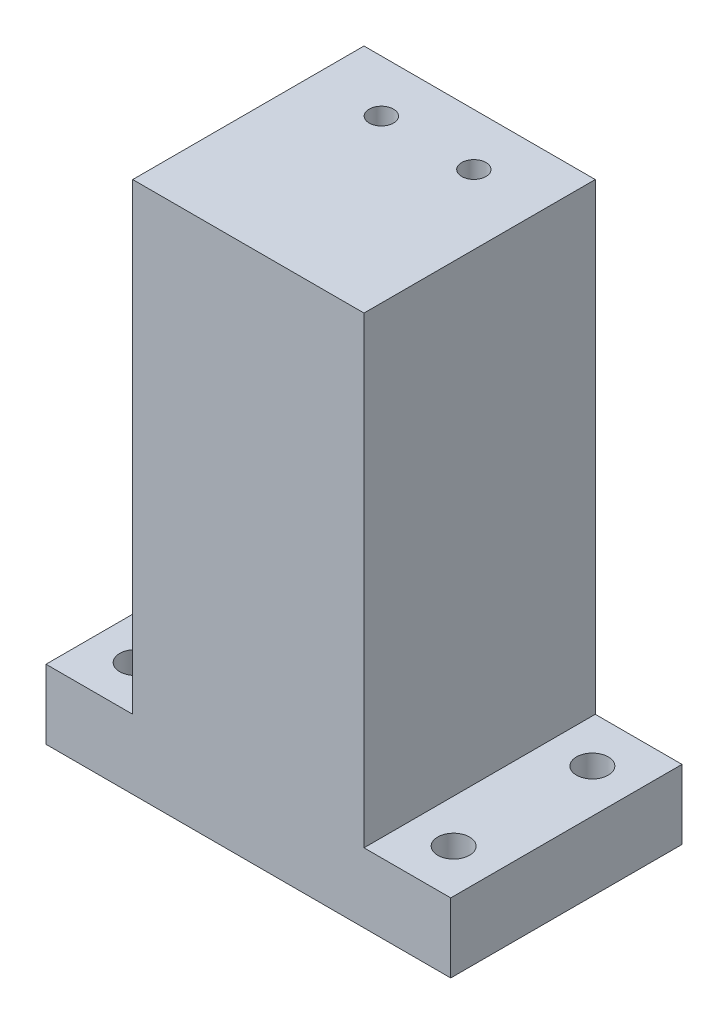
from build123d import *

# Parameters (mm, degrees)
EXTRUDE_1_DEPTH     = 40
SKETCH_2_R          = 2.75
CUT_EXTRUDE_1_DEPTH = 40
SKETCH_3_R          = 2.1
CUT_EXTRUDE_2_DEPTH = 15


with BuildPart() as part:
    # Sketch 1 → Extrude 1 (new body)
    with BuildSketch(Plane.XY):
        Polygon((15, 12), (15, 92.1), (55, 92.1), (55, 12), (70, 12), (70, 0), (0, 0), (0, 12), align=None)
    extrude(amount=EXTRUDE_1_DEPTH)

    # Sketch 2 → Cut-Extrude 1 (cut)
    with BuildSketch(Plane(origin=(0, 12, 0), x_dir=(1, 0, 0), z_dir=(0, 1, 0))):
        with Locations(Location((62.5, -8, 0), (0, 0, 270))):
            Circle(SKETCH_2_R)
        with Locations(Location((62.5, -32, 0), (0, 0, 270))):
            Circle(SKETCH_2_R)
        with Locations(Location((7.5, -32, 0), (0, 0, 270))):
            Circle(SKETCH_2_R)
        with Locations(Location((7.5, -8, 0), (0, 0, 270))):
            Circle(SKETCH_2_R)
    extrude(amount=-CUT_EXTRUDE_1_DEPTH, mode=Mode.SUBTRACT)

    # Sketch 3 → Cut-Extrude 2 (cut)
    with BuildSketch(Plane(origin=(0, 92.1, 0), x_dir=(1, 0, 0), z_dir=(0, 1, 0))):
        with Locations(Location((27, -9, 0), (0, 0, 270))):
            Circle(SKETCH_3_R)
        with Locations(Location((43, -9, 0), (0, 0, 270))):
            Circle(SKETCH_3_R)
    extrude(amount=-CUT_EXTRUDE_2_DEPTH, mode=Mode.SUBTRACT)


solid = part.part
